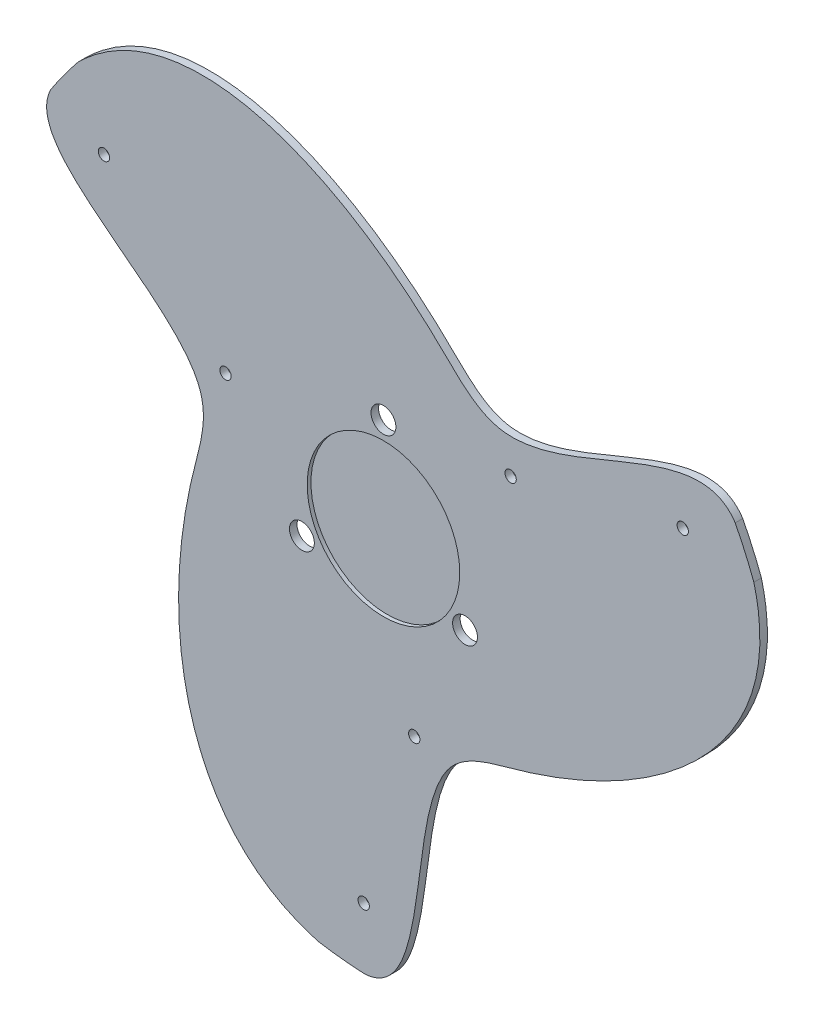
from build123d import *

# Parameters (mm, degrees)
ESQUISSE1_R                  = 105
EXTRUSION1_DEPTH             = 2
D_GAGEMENT_M61_D             = 6.6
D_GAGEMENT_M61_DEPTH         = 20.5
D_GAGEMENT_M61_TIP           = 1.982840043
EXTRUSION3_DEPTH             = 10
ESQUISSE8_R                  = 1.500000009
ENL_V_MAT_EXTRU_2_DEPTH      = 149.505892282
R_P_TITION_CIRCULAIRE2_COUNT = 3
ESQUISSE9_R                  = 17
ESQUISSE9_R_2                = 12
EXTRUSION4_DEPTH             = 4
R_P_TITION_CIRCULAIRE3_COUNT = 3
ESQUISSE10_R                 = 1.5
ENL_V_MAT_EXTRU_3_DEPTH      = 3
R_P_TITION_CIRCULAIRE4_COUNT = 3
EXTRUSION5_DEPTH             = 10
EXTRUSION5_DEPTH_BACK        = 1
ESQUISSE11_R                 = 20.25


with BuildPart() as part:
    # Esquisse1 → Extrusion1 (new body)
    with BuildSketch(Plane.XY):
        Circle(ESQUISSE1_R)
    extrude(amount=EXTRUSION1_DEPTH)

    # D_gagement M61
    with Locations(Plane(origin=(0, 25, 2), x_dir=(1, 0, 0), z_dir=(0, 0, 1))):
        with Locations((0, 0), (21.650635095, -37.5), (-21.650635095, -37.5)):
            Hole(D_GAGEMENT_M61_D / 2, depth=D_GAGEMENT_M61_DEPTH)
            with Locations((0, 0, -(D_GAGEMENT_M61_DEPTH + D_GAGEMENT_M61_TIP / 2))):  # 118° drill point
                Cone(0, D_GAGEMENT_M61_D / 2, D_GAGEMENT_M61_TIP, mode=Mode.SUBTRACT)

    # Esquisse6 → Extrusion3 (cut)
    with BuildSketch(Plane(origin=(0, 0, 0), x_dir=(-1, 0, 0), z_dir=(0, 0, -1))):
        with BuildLine():
            Line((-94.755763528, 45.236548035), (-335.921727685, 45.236548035))
            Line((-335.921727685, 45.236548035), (181.666853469, 258.445148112))
            Line((181.666853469, 258.445148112), (81.068464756, 66.730083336))
            add(Edge.make_bspline(
                [(81.068464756, 66.730083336), (54.738265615, 92.773230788), (7.694712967, 75.44037442), (-38.317102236, 24.310051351), (-86.711402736, 66.717234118), (-94.755763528, 45.236548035)],
                knots=[0, 0, 0, 0, 0.603262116, 0.703262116, 1, 1, 1, 1], degree=3))
        make_face()
    extrusion3 = extrude(amount=-EXTRUSION3_DEPTH, mode=Mode.SUBTRACT)

    # Esquisse8 → Enl_v. mat.-Extru.2 (cut, through all)
    with BuildSketch(Plane.XY.offset(2)):
        with Locations((79.448391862, 39.80748679)):
            Circle(ESQUISSE8_R)
    enl_v_mat_extru_2 = extrude(amount=-ENL_V_MAT_EXTRU_2_DEPTH, mode=Mode.SUBTRACT)

    # R_p_tition circulaire2: Extrusion3 ×3 about axis
    r_p_tition_circulaire2_axis = Axis((0, 0, 2), (0, 0, 1))
    for i in range(1, R_P_TITION_CIRCULAIRE2_COUNT):
        add(extrusion3.rotate(r_p_tition_circulaire2_axis, i * 360 / R_P_TITION_CIRCULAIRE2_COUNT), mode=Mode.SUBTRACT)

    # Esquisse9 → Extrusion4 (add)
    with BuildSketch(Plane.XY.offset(2)):
        Circle(ESQUISSE9_R)
        Circle(ESQUISSE9_R_2, mode=Mode.SUBTRACT)
    extrude(amount=EXTRUSION4_DEPTH)

    # R_p_tition circulaire3: Enl_v. mat.-Extru.2 ×3 about axis
    r_p_tition_circulaire3_axis = Axis((0, 0, 0), (0, 0, 1))
    for i in range(1, R_P_TITION_CIRCULAIRE3_COUNT):
        add(enl_v_mat_extru_2.rotate(r_p_tition_circulaire3_axis, i * 360 / R_P_TITION_CIRCULAIRE3_COUNT), mode=Mode.SUBTRACT)

    # Esquisse10 → Enl_v. mat.-Extru.3 (cut)
    with BuildSketch(Plane.XY.offset(2)):
        with Locations((33.755419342, 28.92409922)):
            Circle(ESQUISSE10_R)
    enl_v_mat_extru_3 = extrude(amount=-ENL_V_MAT_EXTRU_3_DEPTH, mode=Mode.SUBTRACT)

    # R_p_tition circulaire4: Enl_v. mat.-Extru.3 ×3 about axis
    r_p_tition_circulaire4_axis = Axis((0, 0, 0), (0, 0, 1))
    for i in range(1, R_P_TITION_CIRCULAIRE4_COUNT):
        add(enl_v_mat_extru_3.rotate(r_p_tition_circulaire4_axis, i * 360 / R_P_TITION_CIRCULAIRE4_COUNT), mode=Mode.SUBTRACT)

    # Esquisse11 → Extrusion5 (cut, two sides: drawn at the far end of the back side and taken through both)
    with BuildSketch(Plane.XY.offset(2).offset(-EXTRUSION5_DEPTH_BACK)):
        Circle(ESQUISSE11_R)
    extrude(amount=EXTRUSION5_DEPTH + EXTRUSION5_DEPTH_BACK, mode=Mode.SUBTRACT)


solid = part.part
